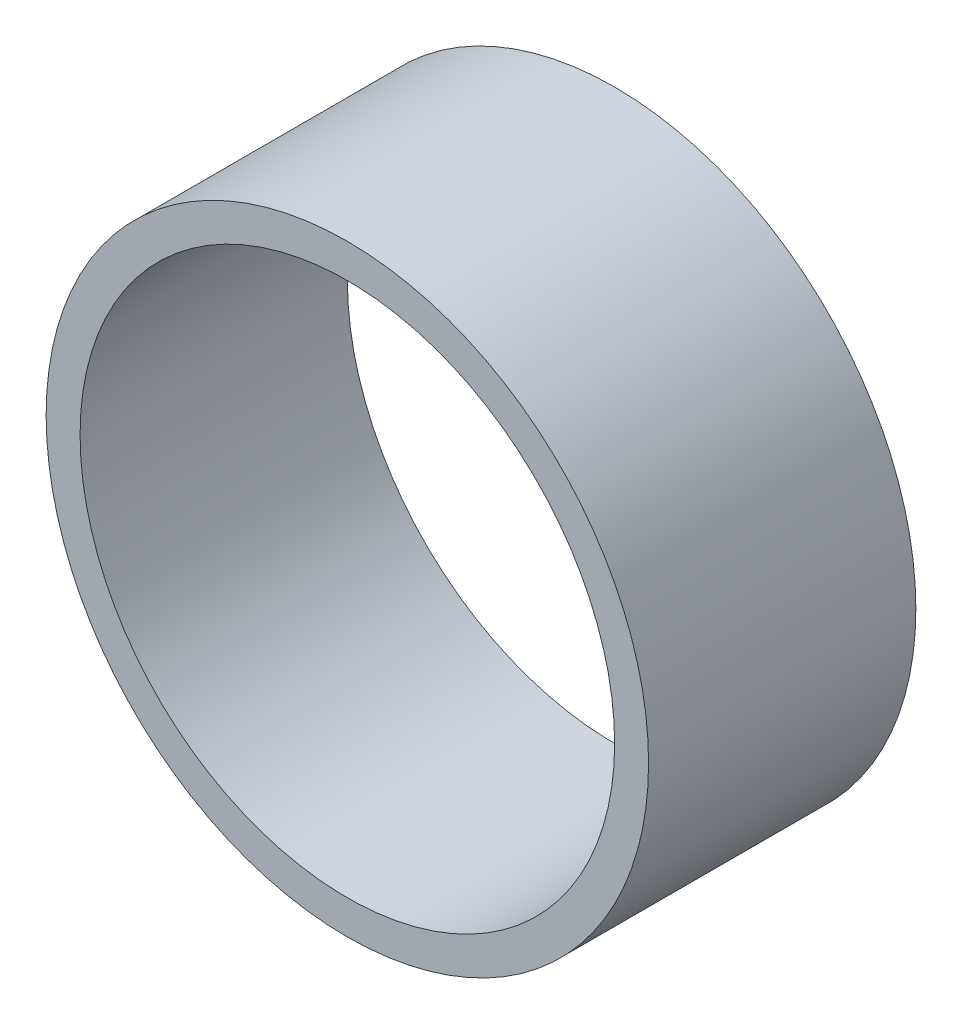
ISO-10303-21;
HEADER;
FILE_DESCRIPTION(('STEP AP214'),'2;1');
FILE_NAME('part.step','',(''),(''),'','','');
FILE_SCHEMA(('AUTOMOTIVE_DESIGN { 1 0 10303 214 1 1 1 1 }'));
ENDSEC;
DATA;
#1=APPLICATION_CONTEXT('core data for automotive mechanical design processes');
#2=APPLICATION_PROTOCOL_DEFINITION('international standard','automotive_design',2000,#1);
#3=PRODUCT_CONTEXT('',#1,'mechanical');
#4=PRODUCT('Part','Part','',(#3));
#5=PRODUCT_RELATED_PRODUCT_CATEGORY('part','',(#4));
#6=PRODUCT_DEFINITION_FORMATION('','',#4);
#7=PRODUCT_DEFINITION_CONTEXT('part definition',#1,'design');
#8=PRODUCT_DEFINITION('design','',#6,#7);
#9=PRODUCT_DEFINITION_SHAPE('','',#8);
#10=(LENGTH_UNIT() NAMED_UNIT(*) SI_UNIT(.MILLI.,.METRE.));
#11=(NAMED_UNIT(*) PLANE_ANGLE_UNIT() SI_UNIT($,.RADIAN.));
#12=(NAMED_UNIT(*) SI_UNIT($,.STERADIAN.) SOLID_ANGLE_UNIT());
#13=UNCERTAINTY_MEASURE_WITH_UNIT(LENGTH_MEASURE(1.E-05),#10,'distance_accuracy_value','');
#14=(GEOMETRIC_REPRESENTATION_CONTEXT(3) GLOBAL_UNCERTAINTY_ASSIGNED_CONTEXT((#13)) GLOBAL_UNIT_ASSIGNED_CONTEXT((#10,
#11,#12)) REPRESENTATION_CONTEXT('',''));
#15=CARTESIAN_POINT('',(0.,0.,0.));
#16=DIRECTION('',(0.,0.,1.));
#17=DIRECTION('',(1.,0.,0.));
#18=AXIS2_PLACEMENT_3D('',#15,#16,#17);
#19=CARTESIAN_POINT('',(0.,0.,6.35));
#20=DIRECTION('',(0.,0.,1.));
#21=DIRECTION('',(1.,0.,0.));
#22=AXIS2_PLACEMENT_3D('',#19,#20,#21);
#23=PLANE('',#22);
#24=CARTESIAN_POINT('',(0.,0.,6.35));
#25=DIRECTION('',(0.,0.,1.));
#26=DIRECTION('',(1.,0.,0.));
#27=AXIS2_PLACEMENT_3D('',#24,#25,#26);
#28=CIRCLE('',#27,14.3129);
#29=CARTESIAN_POINT('',(14.3129,0.,6.35));
#30=VERTEX_POINT('',#29);
#31=EDGE_CURVE('E10',#30,#30,#28,.T.);
#32=ORIENTED_EDGE('',*,*,#31,.T.);
#33=EDGE_LOOP('',(#32));
#34=FACE_BOUND('',#33,.T.);
#35=CARTESIAN_POINT('',(0.,0.,6.35));
#36=DIRECTION('',(0.,0.,1.));
#37=DIRECTION('',(1.,0.,0.));
#38=AXIS2_PLACEMENT_3D('',#35,#36,#37);
#39=CIRCLE('',#38,12.7);
#40=CARTESIAN_POINT('',(12.7,0.,6.35));
#41=VERTEX_POINT('',#40);
#42=EDGE_CURVE('E43',#41,#41,#39,.T.);
#43=ORIENTED_EDGE('',*,*,#42,.F.);
#44=EDGE_LOOP('',(#43));
#45=FACE_BOUND('',#44,.T.);
#46=ADVANCED_FACE('F32',(#34,#45),#23,.T.);
#47=CARTESIAN_POINT('',(0.,0.,-6.35));
#48=DIRECTION('',(0.,0.,1.));
#49=DIRECTION('',(1.,0.,0.));
#50=AXIS2_PLACEMENT_3D('',#47,#48,#49);
#51=PLANE('',#50);
#52=CARTESIAN_POINT('',(0.,0.,-6.35));
#53=DIRECTION('',(0.,0.,1.));
#54=DIRECTION('',(1.,0.,0.));
#55=AXIS2_PLACEMENT_3D('',#52,#53,#54);
#56=CIRCLE('',#55,14.3129);
#57=CARTESIAN_POINT('',(14.3129,0.,-6.35));
#58=VERTEX_POINT('',#57);
#59=EDGE_CURVE('E36',#58,#58,#56,.T.);
#60=ORIENTED_EDGE('',*,*,#59,.F.);
#61=EDGE_LOOP('',(#60));
#62=FACE_BOUND('',#61,.T.);
#63=CARTESIAN_POINT('',(0.,0.,-6.35));
#64=DIRECTION('',(0.,0.,1.));
#65=DIRECTION('',(1.,0.,0.));
#66=AXIS2_PLACEMENT_3D('',#63,#64,#65);
#67=CIRCLE('',#66,12.7);
#68=CARTESIAN_POINT('',(12.7,0.,-6.35));
#69=VERTEX_POINT('',#68);
#70=EDGE_CURVE('E45',#69,#69,#67,.T.);
#71=ORIENTED_EDGE('',*,*,#70,.T.);
#72=EDGE_LOOP('',(#71));
#73=FACE_BOUND('',#72,.T.);
#74=ADVANCED_FACE('F55',(#62,#73),#51,.F.);
#75=CARTESIAN_POINT('',(0.,0.,6.35));
#76=DIRECTION('',(0.,0.,-1.));
#77=DIRECTION('',(-1.,0.,0.));
#78=AXIS2_PLACEMENT_3D('',#75,#76,#77);
#79=CYLINDRICAL_SURFACE('',#78,14.3129);
#80=ORIENTED_EDGE('',*,*,#31,.F.);
#81=EDGE_LOOP('',(#80));
#82=FACE_BOUND('',#81,.T.);
#83=ORIENTED_EDGE('',*,*,#59,.T.);
#84=EDGE_LOOP('',(#83));
#85=FACE_BOUND('',#84,.T.);
#86=ADVANCED_FACE('F34',(#82,#85),#79,.T.);
#87=CARTESIAN_POINT('',(0.,0.,6.35));
#88=DIRECTION('',(0.,0.,-1.));
#89=DIRECTION('',(-1.,0.,0.));
#90=AXIS2_PLACEMENT_3D('',#87,#88,#89);
#91=CYLINDRICAL_SURFACE('',#90,12.7);
#92=ORIENTED_EDGE('',*,*,#42,.T.);
#93=EDGE_LOOP('',(#92));
#94=FACE_BOUND('',#93,.T.);
#95=ORIENTED_EDGE('',*,*,#70,.F.);
#96=EDGE_LOOP('',(#95));
#97=FACE_BOUND('',#96,.T.);
#98=ADVANCED_FACE('F51',(#94,#97),#91,.F.);
#99=CLOSED_SHELL('',(#46,#74,#86,#98));
#100=MANIFOLD_SOLID_BREP('B2',#99);
#101=ADVANCED_BREP_SHAPE_REPRESENTATION('',(#18,#100),#14);
#102=SHAPE_DEFINITION_REPRESENTATION(#9,#101);
ENDSEC;
END-ISO-10303-21;
